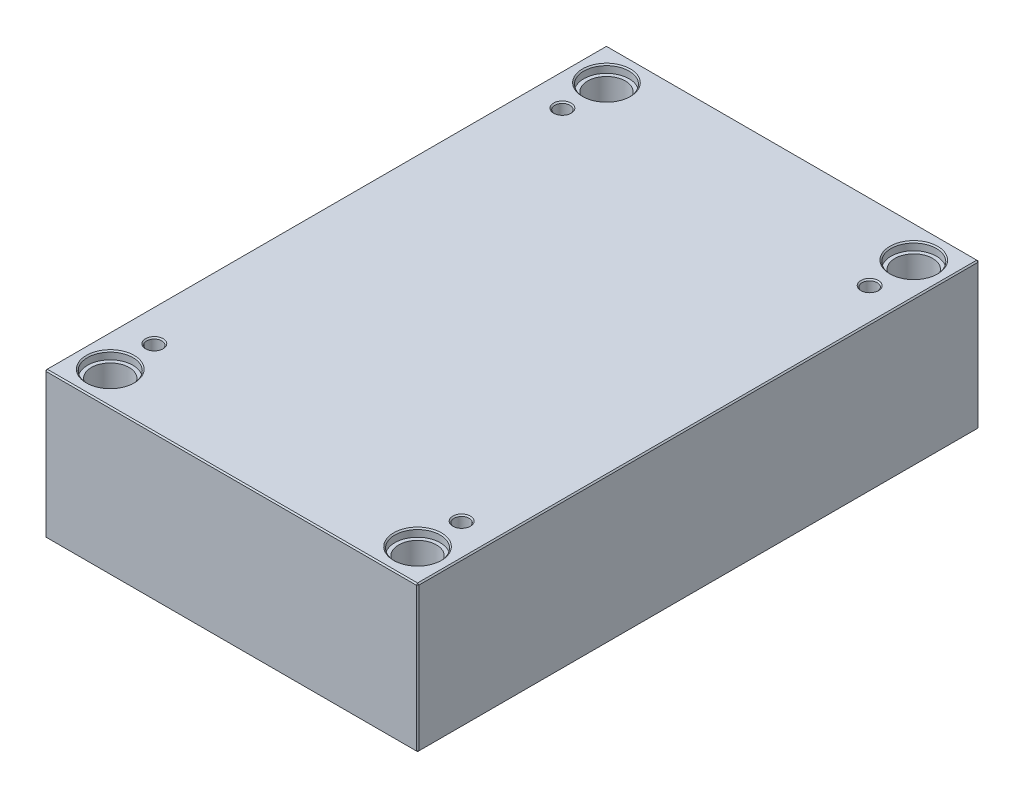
ISO-10303-21;
HEADER;
FILE_DESCRIPTION(('STEP AP214'),'2;1');
FILE_NAME('part.step','',(''),(''),'','','');
FILE_SCHEMA(('AUTOMOTIVE_DESIGN { 1 0 10303 214 1 1 1 1 }'));
ENDSEC;
DATA;
#1=APPLICATION_CONTEXT('core data for automotive mechanical design processes');
#2=APPLICATION_PROTOCOL_DEFINITION('international standard','automotive_design',2000,#1);
#3=PRODUCT_CONTEXT('',#1,'mechanical');
#4=PRODUCT('Part','Part','',(#3));
#5=PRODUCT_RELATED_PRODUCT_CATEGORY('part','',(#4));
#6=PRODUCT_DEFINITION_FORMATION('','',#4);
#7=PRODUCT_DEFINITION_CONTEXT('part definition',#1,'design');
#8=PRODUCT_DEFINITION('design','',#6,#7);
#9=PRODUCT_DEFINITION_SHAPE('','',#8);
#10=(LENGTH_UNIT() NAMED_UNIT(*) SI_UNIT(.MILLI.,.METRE.));
#11=(NAMED_UNIT(*) PLANE_ANGLE_UNIT() SI_UNIT($,.RADIAN.));
#12=(NAMED_UNIT(*) SI_UNIT($,.STERADIAN.) SOLID_ANGLE_UNIT());
#13=UNCERTAINTY_MEASURE_WITH_UNIT(LENGTH_MEASURE(1.E-05),#10,'distance_accuracy_value','');
#14=(GEOMETRIC_REPRESENTATION_CONTEXT(3) GLOBAL_UNCERTAINTY_ASSIGNED_CONTEXT((#13)) GLOBAL_UNIT_ASSIGNED_CONTEXT((#10,
#11,#12)) REPRESENTATION_CONTEXT('',''));
#15=CARTESIAN_POINT('',(0.,0.,0.));
#16=DIRECTION('',(0.,0.,1.));
#17=DIRECTION('',(1.,0.,0.));
#18=AXIS2_PLACEMENT_3D('',#15,#16,#17);
#19=CARTESIAN_POINT('',(-122.,0.,-197.));
#20=DIRECTION('',(0.,1.,0.));
#21=DIRECTION('',(0.,0.,1.));
#22=AXIS2_PLACEMENT_3D('',#19,#20,#21);
#23=CYLINDRICAL_SURFACE('',#22,15.);
#24=CARTESIAN_POINT('',(-122.,0.999999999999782,-197.));
#25=DIRECTION('',(0.,1.,0.));
#26=DIRECTION('',(0.,0.,1.));
#27=AXIS2_PLACEMENT_3D('',#24,#25,#26);
#28=CIRCLE('',#27,15.);
#29=CARTESIAN_POINT('',(-122.,0.999999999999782,-182.));
#30=VERTEX_POINT('',#29);
#31=EDGE_CURVE('E472',#30,#30,#28,.F.);
#32=ORIENTED_EDGE('',*,*,#31,.T.);
#33=EDGE_LOOP('',(#32));
#34=FACE_BOUND('',#33,.T.);
#35=CARTESIAN_POINT('',(-122.,109.7,-197.));
#36=DIRECTION('',(0.,1.,0.));
#37=DIRECTION('',(0.,0.,1.));
#38=AXIS2_PLACEMENT_3D('',#35,#36,#37);
#39=CIRCLE('',#38,15.);
#40=CARTESIAN_POINT('',(-122.,109.7,-182.));
#41=VERTEX_POINT('',#40);
#42=EDGE_CURVE('E221',#41,#41,#39,.F.);
#43=ORIENTED_EDGE('',*,*,#42,.F.);
#44=EDGE_LOOP('',(#43));
#45=FACE_BOUND('',#44,.T.);
#46=ADVANCED_FACE('F16',(#34,#45),#23,.F.);
#47=CARTESIAN_POINT('',(122.,0.,-197.));
#48=DIRECTION('',(0.,1.,0.));
#49=DIRECTION('',(0.,0.,1.));
#50=AXIS2_PLACEMENT_3D('',#47,#48,#49);
#51=CYLINDRICAL_SURFACE('',#50,15.);
#52=CARTESIAN_POINT('',(122.,0.999999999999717,-197.));
#53=DIRECTION('',(0.,1.,0.));
#54=DIRECTION('',(0.,0.,1.));
#55=AXIS2_PLACEMENT_3D('',#52,#53,#54);
#56=CIRCLE('',#55,15.);
#57=CARTESIAN_POINT('',(122.,0.999999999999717,-182.));
#58=VERTEX_POINT('',#57);
#59=EDGE_CURVE('E474',#58,#58,#56,.F.);
#60=ORIENTED_EDGE('',*,*,#59,.T.);
#61=EDGE_LOOP('',(#60));
#62=FACE_BOUND('',#61,.T.);
#63=CARTESIAN_POINT('',(122.,109.7,-197.));
#64=DIRECTION('',(0.,1.,0.));
#65=DIRECTION('',(0.,0.,1.));
#66=AXIS2_PLACEMENT_3D('',#63,#64,#65);
#67=CIRCLE('',#66,15.);
#68=CARTESIAN_POINT('',(122.,109.7,-182.));
#69=VERTEX_POINT('',#68);
#70=EDGE_CURVE('E218',#69,#69,#67,.F.);
#71=ORIENTED_EDGE('',*,*,#70,.F.);
#72=EDGE_LOOP('',(#71));
#73=FACE_BOUND('',#72,.T.);
#74=ADVANCED_FACE('F263',(#62,#73),#51,.F.);
#75=CARTESIAN_POINT('',(122.,0.,197.));
#76=DIRECTION('',(0.,1.,0.));
#77=DIRECTION('',(0.,0.,1.));
#78=AXIS2_PLACEMENT_3D('',#75,#76,#77);
#79=CYLINDRICAL_SURFACE('',#78,15.);
#80=CARTESIAN_POINT('',(122.,0.999999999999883,197.));
#81=DIRECTION('',(0.,1.,0.));
#82=DIRECTION('',(0.,0.,1.));
#83=AXIS2_PLACEMENT_3D('',#80,#81,#82);
#84=CIRCLE('',#83,15.);
#85=CARTESIAN_POINT('',(122.,0.999999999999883,212.));
#86=VERTEX_POINT('',#85);
#87=EDGE_CURVE('E477',#86,#86,#84,.F.);
#88=ORIENTED_EDGE('',*,*,#87,.T.);
#89=EDGE_LOOP('',(#88));
#90=FACE_BOUND('',#89,.T.);
#91=CARTESIAN_POINT('',(122.,109.7,197.));
#92=DIRECTION('',(0.,1.,0.));
#93=DIRECTION('',(0.,0.,1.));
#94=AXIS2_PLACEMENT_3D('',#91,#92,#93);
#95=CIRCLE('',#94,15.);
#96=CARTESIAN_POINT('',(122.,109.7,212.));
#97=VERTEX_POINT('',#96);
#98=EDGE_CURVE('E214',#97,#97,#95,.F.);
#99=ORIENTED_EDGE('',*,*,#98,.F.);
#100=EDGE_LOOP('',(#99));
#101=FACE_BOUND('',#100,.T.);
#102=ADVANCED_FACE('F270',(#90,#101),#79,.F.);
#103=CARTESIAN_POINT('',(-122.,0.,197.));
#104=DIRECTION('',(0.,1.,0.));
#105=DIRECTION('',(0.,0.,1.));
#106=AXIS2_PLACEMENT_3D('',#103,#104,#105);
#107=CYLINDRICAL_SURFACE('',#106,15.);
#108=CARTESIAN_POINT('',(-122.,0.999999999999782,197.));
#109=DIRECTION('',(0.,1.,0.));
#110=DIRECTION('',(0.,0.,1.));
#111=AXIS2_PLACEMENT_3D('',#108,#109,#110);
#112=CIRCLE('',#111,15.);
#113=CARTESIAN_POINT('',(-122.,0.999999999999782,212.));
#114=VERTEX_POINT('',#113);
#115=EDGE_CURVE('E480',#114,#114,#112,.F.);
#116=ORIENTED_EDGE('',*,*,#115,.T.);
#117=EDGE_LOOP('',(#116));
#118=FACE_BOUND('',#117,.T.);
#119=CARTESIAN_POINT('',(-122.,109.7,197.));
#120=DIRECTION('',(0.,1.,0.));
#121=DIRECTION('',(0.,0.,1.));
#122=AXIS2_PLACEMENT_3D('',#119,#120,#121);
#123=CIRCLE('',#122,15.);
#124=CARTESIAN_POINT('',(-122.,109.7,212.));
#125=VERTEX_POINT('',#124);
#126=EDGE_CURVE('E211',#125,#125,#123,.F.);
#127=ORIENTED_EDGE('',*,*,#126,.F.);
#128=EDGE_LOOP('',(#127));
#129=FACE_BOUND('',#128,.T.);
#130=ADVANCED_FACE('F277',(#118,#129),#107,.F.);
#131=CARTESIAN_POINT('',(-148.,116.,223.));
#132=DIRECTION('',(1.,0.,0.));
#133=DIRECTION('',(0.,0.,-1.));
#134=AXIS2_PLACEMENT_3D('',#131,#132,#133);
#135=PLANE('',#134);
#136=DIRECTION('',(0.,-1.,0.));
#137=VECTOR('',#136,1.);
#138=CARTESIAN_POINT('',(-148.,116.,-222.));
#139=LINE('',#138,#137);
#140=CARTESIAN_POINT('',(-148.,115.,-222.));
#141=VERTEX_POINT('',#140);
#142=CARTESIAN_POINT('',(-148.,1.,-222.));
#143=VERTEX_POINT('',#142);
#144=EDGE_CURVE('E487',#141,#143,#139,.T.);
#145=ORIENTED_EDGE('',*,*,#144,.T.);
#146=DIRECTION('',(0.,0.,1.));
#147=VECTOR('',#146,1.);
#148=CARTESIAN_POINT('',(-148.,1.,223.));
#149=LINE('',#148,#147);
#150=CARTESIAN_POINT('',(-148.,1.,222.));
#151=VERTEX_POINT('',#150);
#152=EDGE_CURVE('E490',#143,#151,#149,.T.);
#153=ORIENTED_EDGE('',*,*,#152,.T.);
#154=DIRECTION('',(0.,1.,0.));
#155=VECTOR('',#154,1.);
#156=CARTESIAN_POINT('',(-148.,116.,222.));
#157=LINE('',#156,#155);
#158=CARTESIAN_POINT('',(-148.,115.,222.));
#159=VERTEX_POINT('',#158);
#160=EDGE_CURVE('E485',#151,#159,#157,.T.);
#161=ORIENTED_EDGE('',*,*,#160,.T.);
#162=DIRECTION('',(0.,0.,-1.));
#163=VECTOR('',#162,1.);
#164=CARTESIAN_POINT('',(-148.,115.,-223.));
#165=LINE('',#164,#163);
#166=EDGE_CURVE('E483',#159,#141,#165,.T.);
#167=ORIENTED_EDGE('',*,*,#166,.T.);
#168=EDGE_LOOP('',(#145,#153,#161,#167));
#169=FACE_BOUND('',#168,.T.);
#170=ADVANCED_FACE('F298',(#169),#135,.F.);
#171=CARTESIAN_POINT('',(148.,116.,223.));
#172=DIRECTION('',(0.,0.,-1.));
#173=DIRECTION('',(-1.,0.,0.));
#174=AXIS2_PLACEMENT_3D('',#171,#172,#173);
#175=PLANE('',#174);
#176=DIRECTION('',(-1.,0.,0.));
#177=VECTOR('',#176,1.);
#178=CARTESIAN_POINT('',(-148.,115.,223.));
#179=LINE('',#178,#177);
#180=CARTESIAN_POINT('',(147.,115.,223.));
#181=VERTEX_POINT('',#180);
#182=CARTESIAN_POINT('',(-147.,115.,223.));
#183=VERTEX_POINT('',#182);
#184=EDGE_CURVE('E509',#181,#183,#179,.T.);
#185=ORIENTED_EDGE('',*,*,#184,.T.);
#186=DIRECTION('',(0.,-1.,0.));
#187=VECTOR('',#186,1.);
#188=CARTESIAN_POINT('',(-147.,116.,223.));
#189=LINE('',#188,#187);
#190=CARTESIAN_POINT('',(-147.,1.,223.));
#191=VERTEX_POINT('',#190);
#192=EDGE_CURVE('E515',#183,#191,#189,.T.);
#193=ORIENTED_EDGE('',*,*,#192,.T.);
#194=DIRECTION('',(1.,0.,0.));
#195=VECTOR('',#194,1.);
#196=CARTESIAN_POINT('',(148.,1.,223.));
#197=LINE('',#196,#195);
#198=CARTESIAN_POINT('',(147.,1.,223.));
#199=VERTEX_POINT('',#198);
#200=EDGE_CURVE('E513',#191,#199,#197,.T.);
#201=ORIENTED_EDGE('',*,*,#200,.T.);
#202=DIRECTION('',(0.,1.,0.));
#203=VECTOR('',#202,1.);
#204=CARTESIAN_POINT('',(147.,116.,223.));
#205=LINE('',#204,#203);
#206=EDGE_CURVE('E511',#199,#181,#205,.T.);
#207=ORIENTED_EDGE('',*,*,#206,.T.);
#208=EDGE_LOOP('',(#185,#193,#201,#207));
#209=FACE_BOUND('',#208,.T.);
#210=ADVANCED_FACE('F294',(#209),#175,.F.);
#211=CARTESIAN_POINT('',(148.,116.,223.));
#212=DIRECTION('',(-1.,0.,0.));
#213=DIRECTION('',(0.,0.,1.));
#214=AXIS2_PLACEMENT_3D('',#211,#212,#213);
#215=PLANE('',#214);
#216=DIRECTION('',(0.,0.,-1.));
#217=VECTOR('',#216,1.);
#218=CARTESIAN_POINT('',(148.,1.,223.));
#219=LINE('',#218,#217);
#220=CARTESIAN_POINT('',(148.,1.,222.));
#221=VERTEX_POINT('',#220);
#222=CARTESIAN_POINT('',(148.,1.,-222.));
#223=VERTEX_POINT('',#222);
#224=EDGE_CURVE('E504',#221,#223,#219,.T.);
#225=ORIENTED_EDGE('',*,*,#224,.T.);
#226=DIRECTION('',(0.,1.,0.));
#227=VECTOR('',#226,1.);
#228=CARTESIAN_POINT('',(148.,116.,-222.));
#229=LINE('',#228,#227);
#230=CARTESIAN_POINT('',(148.,115.,-222.));
#231=VERTEX_POINT('',#230);
#232=EDGE_CURVE('E506',#223,#231,#229,.T.);
#233=ORIENTED_EDGE('',*,*,#232,.T.);
#234=DIRECTION('',(0.,0.,1.));
#235=VECTOR('',#234,1.);
#236=CARTESIAN_POINT('',(148.,115.,223.));
#237=LINE('',#236,#235);
#238=CARTESIAN_POINT('',(148.,115.,222.));
#239=VERTEX_POINT('',#238);
#240=EDGE_CURVE('E500',#231,#239,#237,.T.);
#241=ORIENTED_EDGE('',*,*,#240,.T.);
#242=DIRECTION('',(0.,-1.,0.));
#243=VECTOR('',#242,1.);
#244=CARTESIAN_POINT('',(148.,116.,222.));
#245=LINE('',#244,#243);
#246=EDGE_CURVE('E502',#239,#221,#245,.T.);
#247=ORIENTED_EDGE('',*,*,#246,.T.);
#248=EDGE_LOOP('',(#225,#233,#241,#247));
#249=FACE_BOUND('',#248,.T.);
#250=ADVANCED_FACE('F290',(#249),#215,.F.);
#251=CARTESIAN_POINT('',(148.,116.,-223.));
#252=DIRECTION('',(0.,0.,1.));
#253=DIRECTION('',(1.,0.,0.));
#254=AXIS2_PLACEMENT_3D('',#251,#252,#253);
#255=PLANE('',#254);
#256=DIRECTION('',(0.,-1.,0.));
#257=VECTOR('',#256,1.);
#258=CARTESIAN_POINT('',(147.,116.,-223.));
#259=LINE('',#258,#257);
#260=CARTESIAN_POINT('',(147.,115.,-223.));
#261=VERTEX_POINT('',#260);
#262=CARTESIAN_POINT('',(147.,1.,-223.));
#263=VERTEX_POINT('',#262);
#264=EDGE_CURVE('E494',#261,#263,#259,.T.);
#265=ORIENTED_EDGE('',*,*,#264,.T.);
#266=DIRECTION('',(-1.,0.,0.));
#267=VECTOR('',#266,1.);
#268=CARTESIAN_POINT('',(148.,1.,-223.));
#269=LINE('',#268,#267);
#270=CARTESIAN_POINT('',(-147.,1.,-223.));
#271=VERTEX_POINT('',#270);
#272=EDGE_CURVE('E138',#263,#271,#269,.T.);
#273=ORIENTED_EDGE('',*,*,#272,.T.);
#274=DIRECTION('',(0.,1.,0.));
#275=VECTOR('',#274,1.);
#276=CARTESIAN_POINT('',(-147.,116.,-223.));
#277=LINE('',#276,#275);
#278=CARTESIAN_POINT('',(-147.,115.,-223.));
#279=VERTEX_POINT('',#278);
#280=EDGE_CURVE('E496',#271,#279,#277,.T.);
#281=ORIENTED_EDGE('',*,*,#280,.T.);
#282=DIRECTION('',(1.,0.,0.));
#283=VECTOR('',#282,1.);
#284=CARTESIAN_POINT('',(148.,115.,-223.));
#285=LINE('',#284,#283);
#286=EDGE_CURVE('E492',#279,#261,#285,.T.);
#287=ORIENTED_EDGE('',*,*,#286,.T.);
#288=EDGE_LOOP('',(#265,#273,#281,#287));
#289=FACE_BOUND('',#288,.T.);
#290=ADVANCED_FACE('F282',(#289),#255,.F.);
#291=CARTESIAN_POINT('',(0.,116.,0.));
#292=DIRECTION('',(0.,1.,0.));
#293=DIRECTION('',(0.,0.,1.));
#294=AXIS2_PLACEMENT_3D('',#291,#292,#293);
#295=PLANE('',#294);
#296=CARTESIAN_POINT('',(122.,116.,197.));
#297=DIRECTION('',(0.,1.,0.));
#298=DIRECTION('',(0.,0.,1.));
#299=AXIS2_PLACEMENT_3D('',#296,#297,#298);
#300=CIRCLE('',#299,19.);
#301=CARTESIAN_POINT('',(122.,116.,216.));
#302=VERTEX_POINT('',#301);
#303=EDGE_CURVE('E236',#302,#302,#300,.F.);
#304=ORIENTED_EDGE('',*,*,#303,.T.);
#305=EDGE_LOOP('',(#304));
#306=FACE_BOUND('',#305,.T.);
#307=CARTESIAN_POINT('',(-122.,116.,197.));
#308=DIRECTION('',(0.,1.,0.));
#309=DIRECTION('',(0.,0.,1.));
#310=AXIS2_PLACEMENT_3D('',#307,#308,#309);
#311=CIRCLE('',#310,19.);
#312=CARTESIAN_POINT('',(-122.,116.,216.));
#313=VERTEX_POINT('',#312);
#314=EDGE_CURVE('E233',#313,#313,#311,.F.);
#315=ORIENTED_EDGE('',*,*,#314,.T.);
#316=EDGE_LOOP('',(#315));
#317=FACE_BOUND('',#316,.T.);
#318=CARTESIAN_POINT('',(122.,116.,-197.));
#319=DIRECTION('',(0.,1.,0.));
#320=DIRECTION('',(0.,0.,1.));
#321=AXIS2_PLACEMENT_3D('',#318,#319,#320);
#322=CIRCLE('',#321,19.);
#323=CARTESIAN_POINT('',(122.,116.,-178.));
#324=VERTEX_POINT('',#323);
#325=EDGE_CURVE('E230',#324,#324,#322,.F.);
#326=ORIENTED_EDGE('',*,*,#325,.T.);
#327=EDGE_LOOP('',(#326));
#328=FACE_BOUND('',#327,.T.);
#329=CARTESIAN_POINT('',(-122.,116.,-197.));
#330=DIRECTION('',(0.,1.,0.));
#331=DIRECTION('',(0.,0.,1.));
#332=AXIS2_PLACEMENT_3D('',#329,#330,#331);
#333=CIRCLE('',#332,19.);
#334=CARTESIAN_POINT('',(-122.,116.,-178.));
#335=VERTEX_POINT('',#334);
#336=EDGE_CURVE('E227',#335,#335,#333,.F.);
#337=ORIENTED_EDGE('',*,*,#336,.T.);
#338=EDGE_LOOP('',(#337));
#339=FACE_BOUND('',#338,.T.);
#340=CARTESIAN_POINT('',(-122.,116.,162.));
#341=DIRECTION('',(0.,1.,0.));
#342=DIRECTION('',(0.,0.,1.));
#343=AXIS2_PLACEMENT_3D('',#340,#341,#342);
#344=CIRCLE('',#343,7.);
#345=CARTESIAN_POINT('',(-122.,116.,169.));
#346=VERTEX_POINT('',#345);
#347=EDGE_CURVE('E198',#346,#346,#344,.F.);
#348=ORIENTED_EDGE('',*,*,#347,.T.);
#349=EDGE_LOOP('',(#348));
#350=FACE_BOUND('',#349,.T.);
#351=CARTESIAN_POINT('',(122.,116.,162.));
#352=DIRECTION('',(0.,1.,0.));
#353=DIRECTION('',(0.,0.,1.));
#354=AXIS2_PLACEMENT_3D('',#351,#352,#353);
#355=CIRCLE('',#354,7.00000000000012);
#356=CARTESIAN_POINT('',(122.,116.,169.));
#357=VERTEX_POINT('',#356);
#358=EDGE_CURVE('E195',#357,#357,#355,.F.);
#359=ORIENTED_EDGE('',*,*,#358,.T.);
#360=EDGE_LOOP('',(#359));
#361=FACE_BOUND('',#360,.T.);
#362=CARTESIAN_POINT('',(122.,116.,-162.));
#363=DIRECTION('',(0.,1.,0.));
#364=DIRECTION('',(0.,0.,1.));
#365=AXIS2_PLACEMENT_3D('',#362,#363,#364);
#366=CIRCLE('',#365,7.00000000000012);
#367=CARTESIAN_POINT('',(122.,116.,-155.));
#368=VERTEX_POINT('',#367);
#369=EDGE_CURVE('E192',#368,#368,#366,.F.);
#370=ORIENTED_EDGE('',*,*,#369,.T.);
#371=EDGE_LOOP('',(#370));
#372=FACE_BOUND('',#371,.T.);
#373=CARTESIAN_POINT('',(-122.,116.,-162.));
#374=DIRECTION('',(0.,1.,0.));
#375=DIRECTION('',(0.,0.,1.));
#376=AXIS2_PLACEMENT_3D('',#373,#374,#375);
#377=CIRCLE('',#376,7.);
#378=CARTESIAN_POINT('',(-122.,116.,-155.));
#379=VERTEX_POINT('',#378);
#380=EDGE_CURVE('E188',#379,#379,#377,.F.);
#381=ORIENTED_EDGE('',*,*,#380,.T.);
#382=EDGE_LOOP('',(#381));
#383=FACE_BOUND('',#382,.T.);
#384=DIRECTION('',(0.,0.,-1.));
#385=VECTOR('',#384,1.);
#386=CARTESIAN_POINT('',(147.,116.,-223.));
#387=LINE('',#386,#385);
#388=CARTESIAN_POINT('',(147.,116.,222.));
#389=VERTEX_POINT('',#388);
#390=CARTESIAN_POINT('',(147.,116.,-222.));
#391=VERTEX_POINT('',#390);
#392=EDGE_CURVE('E31',#389,#391,#387,.T.);
#393=ORIENTED_EDGE('',*,*,#392,.T.);
#394=DIRECTION('',(-1.,0.,0.));
#395=VECTOR('',#394,1.);
#396=CARTESIAN_POINT('',(-148.,116.,-222.));
#397=LINE('',#396,#395);
#398=CARTESIAN_POINT('',(-147.,116.,-222.));
#399=VERTEX_POINT('',#398);
#400=EDGE_CURVE('E189',#391,#399,#397,.T.);
#401=ORIENTED_EDGE('',*,*,#400,.T.);
#402=DIRECTION('',(0.,0.,1.));
#403=VECTOR('',#402,1.);
#404=CARTESIAN_POINT('',(-147.,116.,223.));
#405=LINE('',#404,#403);
#406=CARTESIAN_POINT('',(-147.,116.,222.));
#407=VERTEX_POINT('',#406);
#408=EDGE_CURVE('E518',#399,#407,#405,.T.);
#409=ORIENTED_EDGE('',*,*,#408,.T.);
#410=DIRECTION('',(1.,0.,0.));
#411=VECTOR('',#410,1.);
#412=CARTESIAN_POINT('',(148.,116.,222.));
#413=LINE('',#412,#411);
#414=EDGE_CURVE('E36',#407,#389,#413,.T.);
#415=ORIENTED_EDGE('',*,*,#414,.T.);
#416=EDGE_LOOP('',(#393,#401,#409,#415));
#417=FACE_BOUND('',#416,.T.);
#418=ADVANCED_FACE('F279',(#306,#317,#328,#339,#350,#361,#372,#383,#417),#295,.T.);
#419=CARTESIAN_POINT('',(0.,0.,0.));
#420=DIRECTION('',(0.,1.,0.));
#421=DIRECTION('',(0.,0.,1.));
#422=AXIS2_PLACEMENT_3D('',#419,#420,#421);
#423=PLANE('',#422);
#424=CARTESIAN_POINT('',(-122.,0.,-197.));
#425=DIRECTION('',(0.,1.,0.));
#426=DIRECTION('',(0.,0.,1.));
#427=AXIS2_PLACEMENT_3D('',#424,#425,#426);
#428=CIRCLE('',#427,16.);
#429=CARTESIAN_POINT('',(-122.,0.,-181.));
#430=VERTEX_POINT('',#429);
#431=EDGE_CURVE('E469',#430,#430,#428,.T.);
#432=ORIENTED_EDGE('',*,*,#431,.T.);
#433=EDGE_LOOP('',(#432));
#434=FACE_BOUND('',#433,.T.);
#435=CARTESIAN_POINT('',(122.,0.,-197.));
#436=DIRECTION('',(0.,1.,0.));
#437=DIRECTION('',(0.,0.,1.));
#438=AXIS2_PLACEMENT_3D('',#435,#436,#437);
#439=CIRCLE('',#438,16.);
#440=CARTESIAN_POINT('',(122.,0.,-181.));
#441=VERTEX_POINT('',#440);
#442=EDGE_CURVE('E466',#441,#441,#439,.T.);
#443=ORIENTED_EDGE('',*,*,#442,.T.);
#444=EDGE_LOOP('',(#443));
#445=FACE_BOUND('',#444,.T.);
#446=CARTESIAN_POINT('',(122.,0.,197.));
#447=DIRECTION('',(0.,1.,0.));
#448=DIRECTION('',(0.,0.,1.));
#449=AXIS2_PLACEMENT_3D('',#446,#447,#448);
#450=CIRCLE('',#449,16.);
#451=CARTESIAN_POINT('',(122.,0.,213.));
#452=VERTEX_POINT('',#451);
#453=EDGE_CURVE('E463',#452,#452,#450,.T.);
#454=ORIENTED_EDGE('',*,*,#453,.T.);
#455=EDGE_LOOP('',(#454));
#456=FACE_BOUND('',#455,.T.);
#457=CARTESIAN_POINT('',(-122.,0.,197.));
#458=DIRECTION('',(0.,1.,0.));
#459=DIRECTION('',(0.,0.,1.));
#460=AXIS2_PLACEMENT_3D('',#457,#458,#459);
#461=CIRCLE('',#460,16.);
#462=CARTESIAN_POINT('',(-122.,0.,213.));
#463=VERTEX_POINT('',#462);
#464=EDGE_CURVE('E460',#463,#463,#461,.T.);
#465=ORIENTED_EDGE('',*,*,#464,.T.);
#466=EDGE_LOOP('',(#465));
#467=FACE_BOUND('',#466,.T.);
#468=DIRECTION('',(0.,0.,1.));
#469=VECTOR('',#468,1.);
#470=CARTESIAN_POINT('',(147.,0.,0.));
#471=LINE('',#470,#469);
#472=CARTESIAN_POINT('',(147.,0.,-222.));
#473=VERTEX_POINT('',#472);
#474=CARTESIAN_POINT('',(147.,0.,222.));
#475=VERTEX_POINT('',#474);
#476=EDGE_CURVE('E108',#473,#475,#471,.T.);
#477=ORIENTED_EDGE('',*,*,#476,.T.);
#478=DIRECTION('',(-1.,0.,0.));
#479=VECTOR('',#478,1.);
#480=CARTESIAN_POINT('',(0.,0.,222.));
#481=LINE('',#480,#479);
#482=CARTESIAN_POINT('',(-147.,0.,222.));
#483=VERTEX_POINT('',#482);
#484=EDGE_CURVE('E458',#475,#483,#481,.T.);
#485=ORIENTED_EDGE('',*,*,#484,.T.);
#486=DIRECTION('',(0.,0.,-1.));
#487=VECTOR('',#486,1.);
#488=CARTESIAN_POINT('',(-147.,0.,0.));
#489=LINE('',#488,#487);
#490=CARTESIAN_POINT('',(-147.,0.,-222.));
#491=VERTEX_POINT('',#490);
#492=EDGE_CURVE('E110',#483,#491,#489,.T.);
#493=ORIENTED_EDGE('',*,*,#492,.T.);
#494=DIRECTION('',(1.,0.,0.));
#495=VECTOR('',#494,1.);
#496=CARTESIAN_POINT('',(0.,0.,-222.));
#497=LINE('',#496,#495);
#498=EDGE_CURVE('E104',#491,#473,#497,.T.);
#499=ORIENTED_EDGE('',*,*,#498,.T.);
#500=EDGE_LOOP('',(#477,#485,#493,#499));
#501=FACE_BOUND('',#500,.T.);
#502=ADVANCED_FACE('F106',(#434,#445,#456,#467,#501),#423,.F.);
#503=CARTESIAN_POINT('',(-122.,0.,-197.));
#504=DIRECTION('',(0.,-1.,0.));
#505=DIRECTION('',(0.,0.,-1.));
#506=AXIS2_PLACEMENT_3D('',#503,#504,#505);
#507=CONICAL_SURFACE('',#506,16.,0.785398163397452);
#508=ORIENTED_EDGE('',*,*,#31,.F.);
#509=EDGE_LOOP('',(#508));
#510=FACE_BOUND('',#509,.T.);
#511=ORIENTED_EDGE('',*,*,#431,.F.);
#512=EDGE_LOOP('',(#511));
#513=FACE_BOUND('',#512,.T.);
#514=ADVANCED_FACE('F286',(#510,#513),#507,.F.);
#515=CARTESIAN_POINT('',(122.,0.,-197.));
#516=DIRECTION('',(0.,-1.,0.));
#517=DIRECTION('',(0.,0.,-1.));
#518=AXIS2_PLACEMENT_3D('',#515,#516,#517);
#519=CONICAL_SURFACE('',#518,16.,0.785398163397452);
#520=ORIENTED_EDGE('',*,*,#59,.F.);
#521=EDGE_LOOP('',(#520));
#522=FACE_BOUND('',#521,.T.);
#523=ORIENTED_EDGE('',*,*,#442,.F.);
#524=EDGE_LOOP('',(#523));
#525=FACE_BOUND('',#524,.T.);
#526=ADVANCED_FACE('F305',(#522,#525),#519,.F.);
#527=CARTESIAN_POINT('',(122.,0.,197.));
#528=DIRECTION('',(0.,-1.,0.));
#529=DIRECTION('',(0.,0.,-1.));
#530=AXIS2_PLACEMENT_3D('',#527,#528,#529);
#531=CONICAL_SURFACE('',#530,16.,0.785398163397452);
#532=ORIENTED_EDGE('',*,*,#87,.F.);
#533=EDGE_LOOP('',(#532));
#534=FACE_BOUND('',#533,.T.);
#535=ORIENTED_EDGE('',*,*,#453,.F.);
#536=EDGE_LOOP('',(#535));
#537=FACE_BOUND('',#536,.T.);
#538=ADVANCED_FACE('F309',(#534,#537),#531,.F.);
#539=CARTESIAN_POINT('',(-122.,0.,197.));
#540=DIRECTION('',(0.,-1.,0.));
#541=DIRECTION('',(0.,0.,-1.));
#542=AXIS2_PLACEMENT_3D('',#539,#540,#541);
#543=CONICAL_SURFACE('',#542,16.,0.785398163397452);
#544=ORIENTED_EDGE('',*,*,#115,.F.);
#545=EDGE_LOOP('',(#544));
#546=FACE_BOUND('',#545,.T.);
#547=ORIENTED_EDGE('',*,*,#464,.F.);
#548=EDGE_LOOP('',(#547));
#549=FACE_BOUND('',#548,.T.);
#550=ADVANCED_FACE('F313',(#546,#549),#543,.F.);
#551=CARTESIAN_POINT('',(148.,116.,222.));
#552=DIRECTION('',(-0.707106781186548,0.,-0.707106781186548));
#553=DIRECTION('',(0.,-1.,0.));
#554=AXIS2_PLACEMENT_3D('',#551,#552,#553);
#555=PLANE('',#554);
#556=DIRECTION('',(-0.707106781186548,0.,0.707106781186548));
#557=VECTOR('',#556,1.);
#558=CARTESIAN_POINT('',(147.,115.,223.));
#559=LINE('',#558,#557);
#560=EDGE_CURVE('E126',#181,#239,#559,.F.);
#561=ORIENTED_EDGE('',*,*,#560,.F.);
#562=ORIENTED_EDGE('',*,*,#206,.F.);
#563=DIRECTION('',(0.707106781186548,0.,-0.707106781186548));
#564=VECTOR('',#563,1.);
#565=CARTESIAN_POINT('',(147.,1.,223.));
#566=LINE('',#565,#564);
#567=EDGE_CURVE('E180',#221,#199,#566,.F.);
#568=ORIENTED_EDGE('',*,*,#567,.F.);
#569=ORIENTED_EDGE('',*,*,#246,.F.);
#570=EDGE_LOOP('',(#561,#562,#568,#569));
#571=FACE_BOUND('',#570,.T.);
#572=ADVANCED_FACE('F317',(#571),#555,.F.);
#573=CARTESIAN_POINT('',(147.,115.,223.));
#574=DIRECTION('',(0.577350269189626,0.577350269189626,0.577350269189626));
#575=DIRECTION('',(0.707106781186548,0.,-0.707106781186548));
#576=AXIS2_PLACEMENT_3D('',#573,#574,#575);
#577=PLANE('',#576);
#578=DIRECTION('',(0.,-0.707106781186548,0.707106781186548));
#579=VECTOR('',#578,1.);
#580=CARTESIAN_POINT('',(147.,115.,223.));
#581=LINE('',#580,#579);
#582=EDGE_CURVE('E175',#181,#389,#581,.F.);
#583=ORIENTED_EDGE('',*,*,#582,.F.);
#584=ORIENTED_EDGE('',*,*,#560,.T.);
#585=DIRECTION('',(-0.707106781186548,0.707106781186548,0.));
#586=VECTOR('',#585,1.);
#587=CARTESIAN_POINT('',(147.5,115.5,222.));
#588=LINE('',#587,#586);
#589=EDGE_CURVE('E177',#389,#239,#588,.F.);
#590=ORIENTED_EDGE('',*,*,#589,.F.);
#591=EDGE_LOOP('',(#583,#584,#590));
#592=FACE_BOUND('',#591,.T.);
#593=ADVANCED_FACE('F385',(#592),#577,.T.);
#594=CARTESIAN_POINT('',(147.,1.,223.));
#595=DIRECTION('',(0.577350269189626,-0.577350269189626,0.577350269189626));
#596=DIRECTION('',(0.707106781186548,0.,-0.707106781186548));
#597=AXIS2_PLACEMENT_3D('',#594,#595,#596);
#598=PLANE('',#597);
#599=DIRECTION('',(-0.707106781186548,-0.707106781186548,0.));
#600=VECTOR('',#599,1.);
#601=CARTESIAN_POINT('',(147.5,0.5,222.));
#602=LINE('',#601,#600);
#603=EDGE_CURVE('E124',#221,#475,#602,.T.);
#604=ORIENTED_EDGE('',*,*,#603,.F.);
#605=ORIENTED_EDGE('',*,*,#567,.T.);
#606=DIRECTION('',(0.,0.707106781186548,0.707106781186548));
#607=VECTOR('',#606,1.);
#608=CARTESIAN_POINT('',(147.,1.,223.));
#609=LINE('',#608,#607);
#610=EDGE_CURVE('E172',#475,#199,#609,.T.);
#611=ORIENTED_EDGE('',*,*,#610,.F.);
#612=EDGE_LOOP('',(#604,#605,#611));
#613=FACE_BOUND('',#612,.T.);
#614=ADVANCED_FACE('F381',(#613),#598,.T.);
#615=CARTESIAN_POINT('',(147.,116.,0.));
#616=DIRECTION('',(0.707106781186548,0.707106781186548,0.));
#617=DIRECTION('',(0.,0.,1.));
#618=AXIS2_PLACEMENT_3D('',#615,#616,#617);
#619=PLANE('',#618);
#620=ORIENTED_EDGE('',*,*,#589,.T.);
#621=ORIENTED_EDGE('',*,*,#240,.F.);
#622=DIRECTION('',(0.707106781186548,-0.707106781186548,0.));
#623=VECTOR('',#622,1.);
#624=CARTESIAN_POINT('',(148.,115.,-222.));
#625=LINE('',#624,#623);
#626=EDGE_CURVE('E166',#391,#231,#625,.T.);
#627=ORIENTED_EDGE('',*,*,#626,.F.);
#628=ORIENTED_EDGE('',*,*,#392,.F.);
#629=EDGE_LOOP('',(#620,#621,#627,#628));
#630=FACE_BOUND('',#629,.T.);
#631=ADVANCED_FACE('F377',(#630),#619,.T.);
#632=CARTESIAN_POINT('',(0.,116.,222.));
#633=DIRECTION('',(0.,0.707106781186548,0.707106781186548));
#634=DIRECTION('',(-1.,0.,0.));
#635=AXIS2_PLACEMENT_3D('',#632,#633,#634);
#636=PLANE('',#635);
#637=ORIENTED_EDGE('',*,*,#582,.T.);
#638=ORIENTED_EDGE('',*,*,#414,.F.);
#639=DIRECTION('',(0.,0.707106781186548,-0.707106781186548));
#640=VECTOR('',#639,1.);
#641=CARTESIAN_POINT('',(-147.,115.5,222.5));
#642=LINE('',#641,#640);
#643=EDGE_CURVE('E163',#183,#407,#642,.T.);
#644=ORIENTED_EDGE('',*,*,#643,.F.);
#645=ORIENTED_EDGE('',*,*,#184,.F.);
#646=EDGE_LOOP('',(#637,#638,#644,#645));
#647=FACE_BOUND('',#646,.T.);
#648=ADVANCED_FACE('F373',(#647),#636,.T.);
#649=CARTESIAN_POINT('',(-147.,116.,223.));
#650=DIRECTION('',(0.707106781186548,0.,-0.707106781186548));
#651=DIRECTION('',(0.,-1.,0.));
#652=AXIS2_PLACEMENT_3D('',#649,#650,#651);
#653=PLANE('',#652);
#654=DIRECTION('',(0.707106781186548,0.,0.707106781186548));
#655=VECTOR('',#654,1.);
#656=CARTESIAN_POINT('',(-147.,1.,223.));
#657=LINE('',#656,#655);
#658=EDGE_CURVE('E157',#191,#151,#657,.F.);
#659=ORIENTED_EDGE('',*,*,#658,.F.);
#660=ORIENTED_EDGE('',*,*,#192,.F.);
#661=DIRECTION('',(-0.707106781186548,0.,-0.707106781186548));
#662=VECTOR('',#661,1.);
#663=CARTESIAN_POINT('',(-148.,115.,222.));
#664=LINE('',#663,#662);
#665=EDGE_CURVE('E160',#159,#183,#664,.F.);
#666=ORIENTED_EDGE('',*,*,#665,.F.);
#667=ORIENTED_EDGE('',*,*,#160,.F.);
#668=EDGE_LOOP('',(#659,#660,#666,#667));
#669=FACE_BOUND('',#668,.T.);
#670=ADVANCED_FACE('F369',(#669),#653,.F.);
#671=CARTESIAN_POINT('',(148.,1.,223.));
#672=DIRECTION('',(0.,0.707106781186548,-0.707106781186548));
#673=DIRECTION('',(1.,0.,0.));
#674=AXIS2_PLACEMENT_3D('',#671,#672,#673);
#675=PLANE('',#674);
#676=ORIENTED_EDGE('',*,*,#610,.T.);
#677=ORIENTED_EDGE('',*,*,#200,.F.);
#678=DIRECTION('',(0.,-0.707106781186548,-0.707106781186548));
#679=VECTOR('',#678,1.);
#680=CARTESIAN_POINT('',(-147.,1.,223.));
#681=LINE('',#680,#679);
#682=EDGE_CURVE('E135',#483,#191,#681,.F.);
#683=ORIENTED_EDGE('',*,*,#682,.F.);
#684=ORIENTED_EDGE('',*,*,#484,.F.);
#685=EDGE_LOOP('',(#676,#677,#683,#684));
#686=FACE_BOUND('',#685,.T.);
#687=ADVANCED_FACE('F366',(#686),#675,.F.);
#688=CARTESIAN_POINT('',(148.,1.,223.));
#689=DIRECTION('',(-0.707106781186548,0.707106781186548,0.));
#690=DIRECTION('',(0.,0.,-1.));
#691=AXIS2_PLACEMENT_3D('',#688,#689,#690);
#692=PLANE('',#691);
#693=ORIENTED_EDGE('',*,*,#603,.T.);
#694=ORIENTED_EDGE('',*,*,#476,.F.);
#695=DIRECTION('',(0.707106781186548,0.707106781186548,0.));
#696=VECTOR('',#695,1.);
#697=CARTESIAN_POINT('',(147.5,0.499999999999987,-222.));
#698=LINE('',#697,#696);
#699=EDGE_CURVE('E121',#223,#473,#698,.F.);
#700=ORIENTED_EDGE('',*,*,#699,.F.);
#701=ORIENTED_EDGE('',*,*,#224,.F.);
#702=EDGE_LOOP('',(#693,#694,#700,#701));
#703=FACE_BOUND('',#702,.T.);
#704=ADVANCED_FACE('F119',(#703),#692,.F.);
#705=CARTESIAN_POINT('',(147.,116.,-223.));
#706=DIRECTION('',(-0.707106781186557,0.,0.707106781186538));
#707=DIRECTION('',(0.,-1.,0.));
#708=AXIS2_PLACEMENT_3D('',#705,#706,#707);
#709=PLANE('',#708);
#710=DIRECTION('',(0.707106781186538,0.,0.707106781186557));
#711=VECTOR('',#710,1.);
#712=CARTESIAN_POINT('',(148.,115.,-222.));
#713=LINE('',#712,#711);
#714=EDGE_CURVE('E168',#231,#261,#713,.F.);
#715=ORIENTED_EDGE('',*,*,#714,.F.);
#716=ORIENTED_EDGE('',*,*,#232,.F.);
#717=DIRECTION('',(-0.707106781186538,0.,-0.707106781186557));
#718=VECTOR('',#717,1.);
#719=CARTESIAN_POINT('',(147.,1.,-223.));
#720=LINE('',#719,#718);
#721=EDGE_CURVE('E134',#263,#223,#720,.F.);
#722=ORIENTED_EDGE('',*,*,#721,.F.);
#723=ORIENTED_EDGE('',*,*,#264,.F.);
#724=EDGE_LOOP('',(#715,#716,#722,#723));
#725=FACE_BOUND('',#724,.T.);
#726=ADVANCED_FACE('F359',(#725),#709,.F.);
#727=CARTESIAN_POINT('',(148.,115.,-222.));
#728=DIRECTION('',(0.577350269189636,0.57735026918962,-0.57735026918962));
#729=DIRECTION('',(-0.707106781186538,0.,-0.707106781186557));
#730=AXIS2_PLACEMENT_3D('',#727,#728,#729);
#731=PLANE('',#730);
#732=ORIENTED_EDGE('',*,*,#626,.T.);
#733=ORIENTED_EDGE('',*,*,#714,.T.);
#734=DIRECTION('',(0.,0.707106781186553,0.707106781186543));
#735=VECTOR('',#734,1.);
#736=CARTESIAN_POINT('',(147.,115.5,-222.5));
#737=LINE('',#736,#735);
#738=EDGE_CURVE('E152',#391,#261,#737,.F.);
#739=ORIENTED_EDGE('',*,*,#738,.F.);
#740=EDGE_LOOP('',(#732,#733,#739));
#741=FACE_BOUND('',#740,.T.);
#742=ADVANCED_FACE('F355',(#741),#731,.T.);
#743=CARTESIAN_POINT('',(-148.,115.,222.));
#744=DIRECTION('',(-0.577350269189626,0.577350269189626,0.577350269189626));
#745=DIRECTION('',(0.707106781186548,0.,0.707106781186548));
#746=AXIS2_PLACEMENT_3D('',#743,#744,#745);
#747=PLANE('',#746);
#748=ORIENTED_EDGE('',*,*,#665,.T.);
#749=ORIENTED_EDGE('',*,*,#643,.T.);
#750=DIRECTION('',(-0.707106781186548,-0.707106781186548,0.));
#751=VECTOR('',#750,1.);
#752=CARTESIAN_POINT('',(-148.,115.,222.));
#753=LINE('',#752,#751);
#754=EDGE_CURVE('E143',#159,#407,#753,.F.);
#755=ORIENTED_EDGE('',*,*,#754,.F.);
#756=EDGE_LOOP('',(#748,#749,#755));
#757=FACE_BOUND('',#756,.T.);
#758=ADVANCED_FACE('F351',(#757),#747,.T.);
#759=CARTESIAN_POINT('',(-147.,1.,223.));
#760=DIRECTION('',(-0.577350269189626,-0.577350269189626,0.577350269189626));
#761=DIRECTION('',(0.707106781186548,0.,0.707106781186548));
#762=AXIS2_PLACEMENT_3D('',#759,#760,#761);
#763=PLANE('',#762);
#764=ORIENTED_EDGE('',*,*,#682,.T.);
#765=ORIENTED_EDGE('',*,*,#658,.T.);
#766=DIRECTION('',(-0.707106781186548,0.707106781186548,0.));
#767=VECTOR('',#766,1.);
#768=CARTESIAN_POINT('',(-147.5,0.5,222.));
#769=LINE('',#768,#767);
#770=EDGE_CURVE('E139',#483,#151,#769,.T.);
#771=ORIENTED_EDGE('',*,*,#770,.F.);
#772=EDGE_LOOP('',(#764,#765,#771));
#773=FACE_BOUND('',#772,.T.);
#774=ADVANCED_FACE('F348',(#773),#763,.T.);
#775=CARTESIAN_POINT('',(147.,1.,-223.));
#776=DIRECTION('',(0.577350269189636,-0.57735026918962,-0.57735026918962));
#777=DIRECTION('',(-0.707106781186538,0.,-0.707106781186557));
#778=AXIS2_PLACEMENT_3D('',#775,#776,#777);
#779=PLANE('',#778);
#780=ORIENTED_EDGE('',*,*,#721,.T.);
#781=ORIENTED_EDGE('',*,*,#699,.T.);
#782=DIRECTION('',(0.,-0.707106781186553,0.707106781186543));
#783=VECTOR('',#782,1.);
#784=CARTESIAN_POINT('',(147.,1.,-223.));
#785=LINE('',#784,#783);
#786=EDGE_CURVE('E131',#263,#473,#785,.T.);
#787=ORIENTED_EDGE('',*,*,#786,.F.);
#788=EDGE_LOOP('',(#780,#781,#787));
#789=FACE_BOUND('',#788,.T.);
#790=ADVANCED_FACE('F130',(#789),#779,.T.);
#791=CARTESIAN_POINT('',(0.,116.,-222.));
#792=DIRECTION('',(0.,0.707106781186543,-0.707106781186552));
#793=DIRECTION('',(1.,0.,0.));
#794=AXIS2_PLACEMENT_3D('',#791,#792,#793);
#795=PLANE('',#794);
#796=ORIENTED_EDGE('',*,*,#738,.T.);
#797=ORIENTED_EDGE('',*,*,#286,.F.);
#798=DIRECTION('',(0.,-0.707106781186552,-0.707106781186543));
#799=VECTOR('',#798,1.);
#800=CARTESIAN_POINT('',(-147.,115.,-223.));
#801=LINE('',#800,#799);
#802=EDGE_CURVE('E140',#399,#279,#801,.T.);
#803=ORIENTED_EDGE('',*,*,#802,.F.);
#804=ORIENTED_EDGE('',*,*,#400,.F.);
#805=EDGE_LOOP('',(#796,#797,#803,#804));
#806=FACE_BOUND('',#805,.T.);
#807=ADVANCED_FACE('F341',(#806),#795,.T.);
#808=CARTESIAN_POINT('',(-147.,116.,0.));
#809=DIRECTION('',(-0.707106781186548,0.707106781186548,0.));
#810=DIRECTION('',(0.,0.,-1.));
#811=AXIS2_PLACEMENT_3D('',#808,#809,#810);
#812=PLANE('',#811);
#813=ORIENTED_EDGE('',*,*,#754,.T.);
#814=ORIENTED_EDGE('',*,*,#408,.F.);
#815=DIRECTION('',(0.707106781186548,0.707106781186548,0.));
#816=VECTOR('',#815,1.);
#817=CARTESIAN_POINT('',(-147.5,115.5,-222.));
#818=LINE('',#817,#816);
#819=EDGE_CURVE('E146',#141,#399,#818,.T.);
#820=ORIENTED_EDGE('',*,*,#819,.F.);
#821=ORIENTED_EDGE('',*,*,#166,.F.);
#822=EDGE_LOOP('',(#813,#814,#820,#821));
#823=FACE_BOUND('',#822,.T.);
#824=ADVANCED_FACE('F337',(#823),#812,.T.);
#825=CARTESIAN_POINT('',(-148.,1.,223.));
#826=DIRECTION('',(0.707106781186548,0.707106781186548,0.));
#827=DIRECTION('',(0.,0.,1.));
#828=AXIS2_PLACEMENT_3D('',#825,#826,#827);
#829=PLANE('',#828);
#830=ORIENTED_EDGE('',*,*,#770,.T.);
#831=ORIENTED_EDGE('',*,*,#152,.F.);
#832=DIRECTION('',(0.707106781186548,-0.707106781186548,0.));
#833=VECTOR('',#832,1.);
#834=CARTESIAN_POINT('',(-148.,1.,-222.));
#835=LINE('',#834,#833);
#836=EDGE_CURVE('E529',#491,#143,#835,.F.);
#837=ORIENTED_EDGE('',*,*,#836,.F.);
#838=ORIENTED_EDGE('',*,*,#492,.F.);
#839=EDGE_LOOP('',(#830,#831,#837,#838));
#840=FACE_BOUND('',#839,.T.);
#841=ADVANCED_FACE('F334',(#840),#829,.F.);
#842=CARTESIAN_POINT('',(148.,1.,-223.));
#843=DIRECTION('',(0.,0.707106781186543,0.707106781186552));
#844=DIRECTION('',(-1.,0.,0.));
#845=AXIS2_PLACEMENT_3D('',#842,#843,#844);
#846=PLANE('',#845);
#847=ORIENTED_EDGE('',*,*,#786,.T.);
#848=ORIENTED_EDGE('',*,*,#498,.F.);
#849=DIRECTION('',(0.,0.707106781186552,-0.707106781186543));
#850=VECTOR('',#849,1.);
#851=CARTESIAN_POINT('',(-147.,0.500000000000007,-222.5));
#852=LINE('',#851,#850);
#853=EDGE_CURVE('E526',#271,#491,#852,.F.);
#854=ORIENTED_EDGE('',*,*,#853,.F.);
#855=ORIENTED_EDGE('',*,*,#272,.F.);
#856=EDGE_LOOP('',(#847,#848,#854,#855));
#857=FACE_BOUND('',#856,.T.);
#858=ADVANCED_FACE('F137',(#857),#846,.F.);
#859=CARTESIAN_POINT('',(-147.,115.,-223.));
#860=DIRECTION('',(-0.577350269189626,0.577350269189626,-0.577350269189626));
#861=DIRECTION('',(-0.707106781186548,0.,0.707106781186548));
#862=AXIS2_PLACEMENT_3D('',#859,#860,#861);
#863=PLANE('',#862);
#864=ORIENTED_EDGE('',*,*,#819,.T.);
#865=ORIENTED_EDGE('',*,*,#802,.T.);
#866=DIRECTION('',(0.707106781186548,0.,-0.707106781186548));
#867=VECTOR('',#866,1.);
#868=CARTESIAN_POINT('',(-147.,115.,-223.));
#869=LINE('',#868,#867);
#870=EDGE_CURVE('E524',#141,#279,#869,.T.);
#871=ORIENTED_EDGE('',*,*,#870,.F.);
#872=EDGE_LOOP('',(#864,#865,#871));
#873=FACE_BOUND('',#872,.T.);
#874=ADVANCED_FACE('F327',(#873),#863,.T.);
#875=CARTESIAN_POINT('',(-148.,1.,-222.));
#876=DIRECTION('',(-0.577350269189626,-0.577350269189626,-0.577350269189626));
#877=DIRECTION('',(-0.707106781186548,0.,0.707106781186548));
#878=AXIS2_PLACEMENT_3D('',#875,#876,#877);
#879=PLANE('',#878);
#880=ORIENTED_EDGE('',*,*,#853,.T.);
#881=ORIENTED_EDGE('',*,*,#836,.T.);
#882=DIRECTION('',(-0.707106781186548,0.,0.707106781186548));
#883=VECTOR('',#882,1.);
#884=CARTESIAN_POINT('',(-148.,1.,-222.));
#885=LINE('',#884,#883);
#886=EDGE_CURVE('E455',#271,#143,#885,.T.);
#887=ORIENTED_EDGE('',*,*,#886,.F.);
#888=EDGE_LOOP('',(#880,#881,#887));
#889=FACE_BOUND('',#888,.T.);
#890=ADVANCED_FACE('F323',(#889),#879,.T.);
#891=CARTESIAN_POINT('',(-148.,116.,-222.));
#892=DIRECTION('',(0.707106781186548,0.,0.707106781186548));
#893=DIRECTION('',(0.,-1.,0.));
#894=AXIS2_PLACEMENT_3D('',#891,#892,#893);
#895=PLANE('',#894);
#896=ORIENTED_EDGE('',*,*,#870,.T.);
#897=ORIENTED_EDGE('',*,*,#280,.F.);
#898=ORIENTED_EDGE('',*,*,#886,.T.);
#899=ORIENTED_EDGE('',*,*,#144,.F.);
#900=EDGE_LOOP('',(#896,#897,#898,#899));
#901=FACE_BOUND('',#900,.T.);
#902=ADVANCED_FACE('F319',(#901),#895,.F.);
#903=CARTESIAN_POINT('',(-122.,92.,-162.));
#904=DIRECTION('',(0.,1.,0.));
#905=DIRECTION('',(0.,0.,1.));
#906=AXIS2_PLACEMENT_3D('',#903,#904,#905);
#907=CYLINDRICAL_SURFACE('',#906,6.);
#908=CARTESIAN_POINT('',(-122.,115.,-162.));
#909=DIRECTION('',(0.,1.,0.));
#910=DIRECTION('',(0.,0.,1.));
#911=AXIS2_PLACEMENT_3D('',#908,#909,#910);
#912=CIRCLE('',#911,6.);
#913=CARTESIAN_POINT('',(-122.,115.,-156.));
#914=VERTEX_POINT('',#913);
#915=EDGE_CURVE('E207',#914,#914,#912,.T.);
#916=ORIENTED_EDGE('',*,*,#915,.T.);
#917=EDGE_LOOP('',(#916));
#918=FACE_BOUND('',#917,.T.);
#919=CARTESIAN_POINT('',(-122.,92.,-162.));
#920=DIRECTION('',(0.,1.,0.));
#921=DIRECTION('',(0.,0.,1.));
#922=AXIS2_PLACEMENT_3D('',#919,#920,#921);
#923=CIRCLE('',#922,6.);
#924=CARTESIAN_POINT('',(-122.,92.,-156.));
#925=VERTEX_POINT('',#924);
#926=EDGE_CURVE('E448',#925,#925,#923,.T.);
#927=ORIENTED_EDGE('',*,*,#926,.F.);
#928=EDGE_LOOP('',(#927));
#929=FACE_BOUND('',#928,.T.);
#930=ADVANCED_FACE('F322',(#918,#929),#907,.F.);
#931=CARTESIAN_POINT('',(-122.,92.,-162.));
#932=DIRECTION('',(0.,1.,0.));
#933=DIRECTION('',(0.,0.,1.));
#934=AXIS2_PLACEMENT_3D('',#931,#932,#933);
#935=PLANE('',#934);
#936=ORIENTED_EDGE('',*,*,#926,.T.);
#937=EDGE_LOOP('',(#936));
#938=FACE_BOUND('',#937,.T.);
#939=ADVANCED_FACE('F596',(#938),#935,.T.);
#940=CARTESIAN_POINT('',(122.,92.,-162.));
#941=DIRECTION('',(0.,1.,0.));
#942=DIRECTION('',(0.,0.,1.));
#943=AXIS2_PLACEMENT_3D('',#940,#941,#942);
#944=CYLINDRICAL_SURFACE('',#943,6.);
#945=CARTESIAN_POINT('',(122.,115.,-162.));
#946=DIRECTION('',(0.,1.,0.));
#947=DIRECTION('',(0.,0.,1.));
#948=AXIS2_PLACEMENT_3D('',#945,#946,#947);
#949=CIRCLE('',#948,6.);
#950=CARTESIAN_POINT('',(122.,115.,-156.));
#951=VERTEX_POINT('',#950);
#952=EDGE_CURVE('E204',#951,#951,#949,.T.);
#953=ORIENTED_EDGE('',*,*,#952,.T.);
#954=EDGE_LOOP('',(#953));
#955=FACE_BOUND('',#954,.T.);
#956=CARTESIAN_POINT('',(122.,92.,-162.));
#957=DIRECTION('',(0.,1.,0.));
#958=DIRECTION('',(0.,0.,1.));
#959=AXIS2_PLACEMENT_3D('',#956,#957,#958);
#960=CIRCLE('',#959,6.);
#961=CARTESIAN_POINT('',(122.,92.,-156.));
#962=VERTEX_POINT('',#961);
#963=EDGE_CURVE('E445',#962,#962,#960,.T.);
#964=ORIENTED_EDGE('',*,*,#963,.F.);
#965=EDGE_LOOP('',(#964));
#966=FACE_BOUND('',#965,.T.);
#967=ADVANCED_FACE('F592',(#955,#966),#944,.F.);
#968=CARTESIAN_POINT('',(122.,92.,-162.));
#969=DIRECTION('',(0.,1.,0.));
#970=DIRECTION('',(0.,0.,1.));
#971=AXIS2_PLACEMENT_3D('',#968,#969,#970);
#972=PLANE('',#971);
#973=ORIENTED_EDGE('',*,*,#963,.T.);
#974=EDGE_LOOP('',(#973));
#975=FACE_BOUND('',#974,.T.);
#976=ADVANCED_FACE('F588',(#975),#972,.T.);
#977=CARTESIAN_POINT('',(122.,92.,162.));
#978=DIRECTION('',(0.,1.,0.));
#979=DIRECTION('',(0.,0.,1.));
#980=AXIS2_PLACEMENT_3D('',#977,#978,#979);
#981=CYLINDRICAL_SURFACE('',#980,6.);
#982=CARTESIAN_POINT('',(122.,115.,162.));
#983=DIRECTION('',(0.,1.,0.));
#984=DIRECTION('',(0.,0.,1.));
#985=AXIS2_PLACEMENT_3D('',#982,#983,#984);
#986=CIRCLE('',#985,6.);
#987=CARTESIAN_POINT('',(122.,115.,168.));
#988=VERTEX_POINT('',#987);
#989=EDGE_CURVE('E201',#988,#988,#986,.T.);
#990=ORIENTED_EDGE('',*,*,#989,.T.);
#991=EDGE_LOOP('',(#990));
#992=FACE_BOUND('',#991,.T.);
#993=CARTESIAN_POINT('',(122.,92.,162.));
#994=DIRECTION('',(0.,1.,0.));
#995=DIRECTION('',(0.,0.,1.));
#996=AXIS2_PLACEMENT_3D('',#993,#994,#995);
#997=CIRCLE('',#996,6.);
#998=CARTESIAN_POINT('',(122.,92.,168.));
#999=VERTEX_POINT('',#998);
#1000=EDGE_CURVE('E449',#999,#999,#997,.T.);
#1001=ORIENTED_EDGE('',*,*,#1000,.F.);
#1002=EDGE_LOOP('',(#1001));
#1003=FACE_BOUND('',#1002,.T.);
#1004=ADVANCED_FACE('F591',(#992,#1003),#981,.F.);
#1005=CARTESIAN_POINT('',(122.,92.,162.));
#1006=DIRECTION('',(0.,1.,0.));
#1007=DIRECTION('',(0.,0.,1.));
#1008=AXIS2_PLACEMENT_3D('',#1005,#1006,#1007);
#1009=PLANE('',#1008);
#1010=ORIENTED_EDGE('',*,*,#1000,.T.);
#1011=EDGE_LOOP('',(#1010));
#1012=FACE_BOUND('',#1011,.T.);
#1013=ADVANCED_FACE('F598',(#1012),#1009,.T.);
#1014=CARTESIAN_POINT('',(-122.,92.,162.));
#1015=DIRECTION('',(0.,1.,0.));
#1016=DIRECTION('',(0.,0.,1.));
#1017=AXIS2_PLACEMENT_3D('',#1014,#1015,#1016);
#1018=CYLINDRICAL_SURFACE('',#1017,6.);
#1019=CARTESIAN_POINT('',(-122.,115.,162.));
#1020=DIRECTION('',(0.,1.,0.));
#1021=DIRECTION('',(0.,0.,1.));
#1022=AXIS2_PLACEMENT_3D('',#1019,#1020,#1021);
#1023=CIRCLE('',#1022,6.);
#1024=CARTESIAN_POINT('',(-122.,115.,168.));
#1025=VERTEX_POINT('',#1024);
#1026=EDGE_CURVE('E185',#1025,#1025,#1023,.T.);
#1027=ORIENTED_EDGE('',*,*,#1026,.T.);
#1028=EDGE_LOOP('',(#1027));
#1029=FACE_BOUND('',#1028,.T.);
#1030=CARTESIAN_POINT('',(-122.,92.,162.));
#1031=DIRECTION('',(0.,1.,0.));
#1032=DIRECTION('',(0.,0.,1.));
#1033=AXIS2_PLACEMENT_3D('',#1030,#1031,#1032);
#1034=CIRCLE('',#1033,6.);
#1035=CARTESIAN_POINT('',(-122.,92.,168.));
#1036=VERTEX_POINT('',#1035);
#1037=EDGE_CURVE('E224',#1036,#1036,#1034,.T.);
#1038=ORIENTED_EDGE('',*,*,#1037,.F.);
#1039=EDGE_LOOP('',(#1038));
#1040=FACE_BOUND('',#1039,.T.);
#1041=ADVANCED_FACE('F601',(#1029,#1040),#1018,.F.);
#1042=CARTESIAN_POINT('',(-122.,92.,162.));
#1043=DIRECTION('',(0.,1.,0.));
#1044=DIRECTION('',(0.,0.,1.));
#1045=AXIS2_PLACEMENT_3D('',#1042,#1043,#1044);
#1046=PLANE('',#1045);
#1047=ORIENTED_EDGE('',*,*,#1037,.T.);
#1048=EDGE_LOOP('',(#1047));
#1049=FACE_BOUND('',#1048,.T.);
#1050=ADVANCED_FACE('F397',(#1049),#1046,.T.);
#1051=CARTESIAN_POINT('',(-122.,115.,162.));
#1052=DIRECTION('',(0.,1.,0.));
#1053=DIRECTION('',(0.,0.,1.));
#1054=AXIS2_PLACEMENT_3D('',#1051,#1052,#1053);
#1055=CONICAL_SURFACE('',#1054,6.,0.785398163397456);
#1056=ORIENTED_EDGE('',*,*,#347,.F.);
#1057=EDGE_LOOP('',(#1056));
#1058=FACE_BOUND('',#1057,.T.);
#1059=ORIENTED_EDGE('',*,*,#1026,.F.);
#1060=EDGE_LOOP('',(#1059));
#1061=FACE_BOUND('',#1060,.T.);
#1062=ADVANCED_FACE('F393',(#1058,#1061),#1055,.F.);
#1063=CARTESIAN_POINT('',(122.,115.,162.));
#1064=DIRECTION('',(0.,1.,0.));
#1065=DIRECTION('',(0.,0.,1.));
#1066=AXIS2_PLACEMENT_3D('',#1063,#1064,#1065);
#1067=CONICAL_SURFACE('',#1066,6.,0.785398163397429);
#1068=ORIENTED_EDGE('',*,*,#358,.F.);
#1069=EDGE_LOOP('',(#1068));
#1070=FACE_BOUND('',#1069,.T.);
#1071=ORIENTED_EDGE('',*,*,#989,.F.);
#1072=EDGE_LOOP('',(#1071));
#1073=FACE_BOUND('',#1072,.T.);
#1074=ADVANCED_FACE('F396',(#1070,#1073),#1067,.F.);
#1075=CARTESIAN_POINT('',(122.,115.,-162.));
#1076=DIRECTION('',(0.,1.,0.));
#1077=DIRECTION('',(0.,0.,1.));
#1078=AXIS2_PLACEMENT_3D('',#1075,#1076,#1077);
#1079=CONICAL_SURFACE('',#1078,6.,0.785398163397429);
#1080=ORIENTED_EDGE('',*,*,#369,.F.);
#1081=EDGE_LOOP('',(#1080));
#1082=FACE_BOUND('',#1081,.T.);
#1083=ORIENTED_EDGE('',*,*,#952,.F.);
#1084=EDGE_LOOP('',(#1083));
#1085=FACE_BOUND('',#1084,.T.);
#1086=ADVANCED_FACE('F401',(#1082,#1085),#1079,.F.);
#1087=CARTESIAN_POINT('',(-122.,115.,-162.));
#1088=DIRECTION('',(0.,1.,0.));
#1089=DIRECTION('',(0.,0.,1.));
#1090=AXIS2_PLACEMENT_3D('',#1087,#1088,#1089);
#1091=CONICAL_SURFACE('',#1090,6.,0.785398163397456);
#1092=ORIENTED_EDGE('',*,*,#380,.F.);
#1093=EDGE_LOOP('',(#1092));
#1094=FACE_BOUND('',#1093,.T.);
#1095=ORIENTED_EDGE('',*,*,#915,.F.);
#1096=EDGE_LOOP('',(#1095));
#1097=FACE_BOUND('',#1096,.T.);
#1098=ADVANCED_FACE('F405',(#1094,#1097),#1091,.F.);
#1099=CARTESIAN_POINT('',(-122.,109.7,197.));
#1100=DIRECTION('',(0.,1.,0.));
#1101=DIRECTION('',(0.,0.,1.));
#1102=AXIS2_PLACEMENT_3D('',#1099,#1100,#1101);
#1103=PLANE('',#1102);
#1104=CARTESIAN_POINT('',(-122.,109.7,197.));
#1105=DIRECTION('',(0.,1.,0.));
#1106=DIRECTION('',(0.,0.,1.));
#1107=AXIS2_PLACEMENT_3D('',#1104,#1105,#1106);
#1108=CIRCLE('',#1107,18.);
#1109=CARTESIAN_POINT('',(-122.,109.7,215.));
#1110=VERTEX_POINT('',#1109);
#1111=EDGE_CURVE('E436',#1110,#1110,#1108,.T.);
#1112=ORIENTED_EDGE('',*,*,#1111,.T.);
#1113=EDGE_LOOP('',(#1112));
#1114=FACE_BOUND('',#1113,.T.);
#1115=ORIENTED_EDGE('',*,*,#126,.T.);
#1116=EDGE_LOOP('',(#1115));
#1117=FACE_BOUND('',#1116,.T.);
#1118=ADVANCED_FACE('F409',(#1114,#1117),#1103,.T.);
#1119=CARTESIAN_POINT('',(-122.,109.7,197.));
#1120=DIRECTION('',(0.,1.,0.));
#1121=DIRECTION('',(0.,0.,1.));
#1122=AXIS2_PLACEMENT_3D('',#1119,#1120,#1121);
#1123=CYLINDRICAL_SURFACE('',#1122,18.);
#1124=CARTESIAN_POINT('',(-122.,115.,197.));
#1125=DIRECTION('',(0.,1.,0.));
#1126=DIRECTION('',(0.,0.,1.));
#1127=AXIS2_PLACEMENT_3D('',#1124,#1125,#1126);
#1128=CIRCLE('',#1127,18.);
#1129=CARTESIAN_POINT('',(-122.,115.,215.));
#1130=VERTEX_POINT('',#1129);
#1131=EDGE_CURVE('E239',#1130,#1130,#1128,.T.);
#1132=ORIENTED_EDGE('',*,*,#1131,.T.);
#1133=EDGE_LOOP('',(#1132));
#1134=FACE_BOUND('',#1133,.T.);
#1135=ORIENTED_EDGE('',*,*,#1111,.F.);
#1136=EDGE_LOOP('',(#1135));
#1137=FACE_BOUND('',#1136,.T.);
#1138=ADVANCED_FACE('F574',(#1134,#1137),#1123,.F.);
#1139=CARTESIAN_POINT('',(122.,109.7,197.));
#1140=DIRECTION('',(0.,1.,0.));
#1141=DIRECTION('',(0.,0.,1.));
#1142=AXIS2_PLACEMENT_3D('',#1139,#1140,#1141);
#1143=PLANE('',#1142);
#1144=CARTESIAN_POINT('',(122.,109.7,197.));
#1145=DIRECTION('',(0.,1.,0.));
#1146=DIRECTION('',(0.,0.,1.));
#1147=AXIS2_PLACEMENT_3D('',#1144,#1145,#1146);
#1148=CIRCLE('',#1147,18.);
#1149=CARTESIAN_POINT('',(122.,109.7,215.));
#1150=VERTEX_POINT('',#1149);
#1151=EDGE_CURVE('E433',#1150,#1150,#1148,.T.);
#1152=ORIENTED_EDGE('',*,*,#1151,.T.);
#1153=EDGE_LOOP('',(#1152));
#1154=FACE_BOUND('',#1153,.T.);
#1155=ORIENTED_EDGE('',*,*,#98,.T.);
#1156=EDGE_LOOP('',(#1155));
#1157=FACE_BOUND('',#1156,.T.);
#1158=ADVANCED_FACE('F429',(#1154,#1157),#1143,.T.);
#1159=CARTESIAN_POINT('',(122.,109.7,197.));
#1160=DIRECTION('',(0.,1.,0.));
#1161=DIRECTION('',(0.,0.,1.));
#1162=AXIS2_PLACEMENT_3D('',#1159,#1160,#1161);
#1163=CYLINDRICAL_SURFACE('',#1162,18.);
#1164=CARTESIAN_POINT('',(122.,115.,197.));
#1165=DIRECTION('',(0.,1.,0.));
#1166=DIRECTION('',(0.,0.,1.));
#1167=AXIS2_PLACEMENT_3D('',#1164,#1165,#1166);
#1168=CIRCLE('',#1167,18.);
#1169=CARTESIAN_POINT('',(122.,115.,215.));
#1170=VERTEX_POINT('',#1169);
#1171=EDGE_CURVE('E210',#1170,#1170,#1168,.T.);
#1172=ORIENTED_EDGE('',*,*,#1171,.T.);
#1173=EDGE_LOOP('',(#1172));
#1174=FACE_BOUND('',#1173,.T.);
#1175=ORIENTED_EDGE('',*,*,#1151,.F.);
#1176=EDGE_LOOP('',(#1175));
#1177=FACE_BOUND('',#1176,.T.);
#1178=ADVANCED_FACE('F425',(#1174,#1177),#1163,.F.);
#1179=CARTESIAN_POINT('',(122.,109.7,-197.));
#1180=DIRECTION('',(0.,1.,0.));
#1181=DIRECTION('',(0.,0.,1.));
#1182=AXIS2_PLACEMENT_3D('',#1179,#1180,#1181);
#1183=PLANE('',#1182);
#1184=CARTESIAN_POINT('',(122.,109.7,-197.));
#1185=DIRECTION('',(0.,1.,0.));
#1186=DIRECTION('',(0.,0.,1.));
#1187=AXIS2_PLACEMENT_3D('',#1184,#1185,#1186);
#1188=CIRCLE('',#1187,18.);
#1189=CARTESIAN_POINT('',(122.,109.7,-179.));
#1190=VERTEX_POINT('',#1189);
#1191=EDGE_CURVE('E435',#1190,#1190,#1188,.T.);
#1192=ORIENTED_EDGE('',*,*,#1191,.T.);
#1193=EDGE_LOOP('',(#1192));
#1194=FACE_BOUND('',#1193,.T.);
#1195=ORIENTED_EDGE('',*,*,#70,.T.);
#1196=EDGE_LOOP('',(#1195));
#1197=FACE_BOUND('',#1196,.T.);
#1198=ADVANCED_FACE('F428',(#1194,#1197),#1183,.T.);
#1199=CARTESIAN_POINT('',(122.,109.7,-197.));
#1200=DIRECTION('',(0.,1.,0.));
#1201=DIRECTION('',(0.,0.,1.));
#1202=AXIS2_PLACEMENT_3D('',#1199,#1200,#1201);
#1203=CYLINDRICAL_SURFACE('',#1202,18.);
#1204=CARTESIAN_POINT('',(122.,115.,-197.));
#1205=DIRECTION('',(0.,1.,0.));
#1206=DIRECTION('',(0.,0.,1.));
#1207=AXIS2_PLACEMENT_3D('',#1204,#1205,#1206);
#1208=CIRCLE('',#1207,18.);
#1209=CARTESIAN_POINT('',(122.,115.,-179.));
#1210=VERTEX_POINT('',#1209);
#1211=EDGE_CURVE('E24',#1210,#1210,#1208,.T.);
#1212=ORIENTED_EDGE('',*,*,#1211,.T.);
#1213=EDGE_LOOP('',(#1212));
#1214=FACE_BOUND('',#1213,.T.);
#1215=ORIENTED_EDGE('',*,*,#1191,.F.);
#1216=EDGE_LOOP('',(#1215));
#1217=FACE_BOUND('',#1216,.T.);
#1218=ADVANCED_FACE('F244',(#1214,#1217),#1203,.F.);
#1219=CARTESIAN_POINT('',(-122.,109.7,-197.));
#1220=DIRECTION('',(0.,1.,0.));
#1221=DIRECTION('',(0.,0.,1.));
#1222=AXIS2_PLACEMENT_3D('',#1219,#1220,#1221);
#1223=PLANE('',#1222);
#1224=CARTESIAN_POINT('',(-122.,109.7,-197.));
#1225=DIRECTION('',(0.,1.,0.));
#1226=DIRECTION('',(0.,0.,1.));
#1227=AXIS2_PLACEMENT_3D('',#1224,#1225,#1226);
#1228=CIRCLE('',#1227,18.);
#1229=CARTESIAN_POINT('',(-122.,109.7,-179.));
#1230=VERTEX_POINT('',#1229);
#1231=EDGE_CURVE('E215',#1230,#1230,#1228,.T.);
#1232=ORIENTED_EDGE('',*,*,#1231,.T.);
#1233=EDGE_LOOP('',(#1232));
#1234=FACE_BOUND('',#1233,.T.);
#1235=ORIENTED_EDGE('',*,*,#42,.T.);
#1236=EDGE_LOOP('',(#1235));
#1237=FACE_BOUND('',#1236,.T.);
#1238=ADVANCED_FACE('F418',(#1234,#1237),#1223,.T.);
#1239=CARTESIAN_POINT('',(-122.,109.7,-197.));
#1240=DIRECTION('',(0.,1.,0.));
#1241=DIRECTION('',(0.,0.,1.));
#1242=AXIS2_PLACEMENT_3D('',#1239,#1240,#1241);
#1243=CYLINDRICAL_SURFACE('',#1242,18.);
#1244=CARTESIAN_POINT('',(-122.,115.,-197.));
#1245=DIRECTION('',(0.,1.,0.));
#1246=DIRECTION('',(0.,0.,1.));
#1247=AXIS2_PLACEMENT_3D('',#1244,#1245,#1246);
#1248=CIRCLE('',#1247,18.);
#1249=CARTESIAN_POINT('',(-122.,115.,-179.));
#1250=VERTEX_POINT('',#1249);
#1251=EDGE_CURVE('E10',#1250,#1250,#1248,.T.);
#1252=ORIENTED_EDGE('',*,*,#1251,.T.);
#1253=EDGE_LOOP('',(#1252));
#1254=FACE_BOUND('',#1253,.T.);
#1255=ORIENTED_EDGE('',*,*,#1231,.F.);
#1256=EDGE_LOOP('',(#1255));
#1257=FACE_BOUND('',#1256,.T.);
#1258=ADVANCED_FACE('F412',(#1254,#1257),#1243,.F.);
#1259=CARTESIAN_POINT('',(122.,115.,197.));
#1260=DIRECTION('',(0.,1.,0.));
#1261=DIRECTION('',(0.,0.,1.));
#1262=AXIS2_PLACEMENT_3D('',#1259,#1260,#1261);
#1263=CONICAL_SURFACE('',#1262,18.,0.785398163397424);
#1264=ORIENTED_EDGE('',*,*,#303,.F.);
#1265=EDGE_LOOP('',(#1264));
#1266=FACE_BOUND('',#1265,.T.);
#1267=ORIENTED_EDGE('',*,*,#1171,.F.);
#1268=EDGE_LOOP('',(#1267));
#1269=FACE_BOUND('',#1268,.T.);
#1270=ADVANCED_FACE('F258',(#1266,#1269),#1263,.F.);
#1271=CARTESIAN_POINT('',(-122.,115.,197.));
#1272=DIRECTION('',(0.,1.,0.));
#1273=DIRECTION('',(0.,0.,1.));
#1274=AXIS2_PLACEMENT_3D('',#1271,#1272,#1273);
#1275=CONICAL_SURFACE('',#1274,18.,0.785398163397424);
#1276=ORIENTED_EDGE('',*,*,#314,.F.);
#1277=EDGE_LOOP('',(#1276));
#1278=FACE_BOUND('',#1277,.T.);
#1279=ORIENTED_EDGE('',*,*,#1131,.F.);
#1280=EDGE_LOOP('',(#1279));
#1281=FACE_BOUND('',#1280,.T.);
#1282=ADVANCED_FACE('F249',(#1278,#1281),#1275,.F.);
#1283=CARTESIAN_POINT('',(122.,115.,-197.));
#1284=DIRECTION('',(0.,1.,0.));
#1285=DIRECTION('',(0.,0.,1.));
#1286=AXIS2_PLACEMENT_3D('',#1283,#1284,#1285);
#1287=CONICAL_SURFACE('',#1286,18.,0.785398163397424);
#1288=ORIENTED_EDGE('',*,*,#325,.F.);
#1289=EDGE_LOOP('',(#1288));
#1290=FACE_BOUND('',#1289,.T.);
#1291=ORIENTED_EDGE('',*,*,#1211,.F.);
#1292=EDGE_LOOP('',(#1291));
#1293=FACE_BOUND('',#1292,.T.);
#1294=ADVANCED_FACE('F247',(#1290,#1293),#1287,.F.);
#1295=CARTESIAN_POINT('',(-122.,115.,-197.));
#1296=DIRECTION('',(0.,1.,0.));
#1297=DIRECTION('',(0.,0.,1.));
#1298=AXIS2_PLACEMENT_3D('',#1295,#1296,#1297);
#1299=CONICAL_SURFACE('',#1298,18.,0.785398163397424);
#1300=ORIENTED_EDGE('',*,*,#336,.F.);
#1301=EDGE_LOOP('',(#1300));
#1302=FACE_BOUND('',#1301,.T.);
#1303=ORIENTED_EDGE('',*,*,#1251,.F.);
#1304=EDGE_LOOP('',(#1303));
#1305=FACE_BOUND('',#1304,.T.);
#1306=ADVANCED_FACE('F18',(#1302,#1305),#1299,.F.);
#1307=CLOSED_SHELL('',(#46,#74,#102,#130,#170,#210,#250,#290,#418,#502,#514,#526,#538,#550,#572,
#593,#614,#631,#648,#670,#687,#704,#726,#742,#758,#774,#790,#807,#824,#841,#858,#874,#890,#902,
#930,#939,#967,#976,#1004,#1013,#1041,#1050,#1062,#1074,#1086,#1098,#1118,#1138,#1158,#1178,
#1198,#1218,#1238,#1258,#1270,#1282,#1294,#1306));
#1308=MANIFOLD_SOLID_BREP('B1',#1307);
#1309=ADVANCED_BREP_SHAPE_REPRESENTATION('',(#18,#1308),#14);
#1310=SHAPE_DEFINITION_REPRESENTATION(#9,#1309);
ENDSEC;
END-ISO-10303-21;
